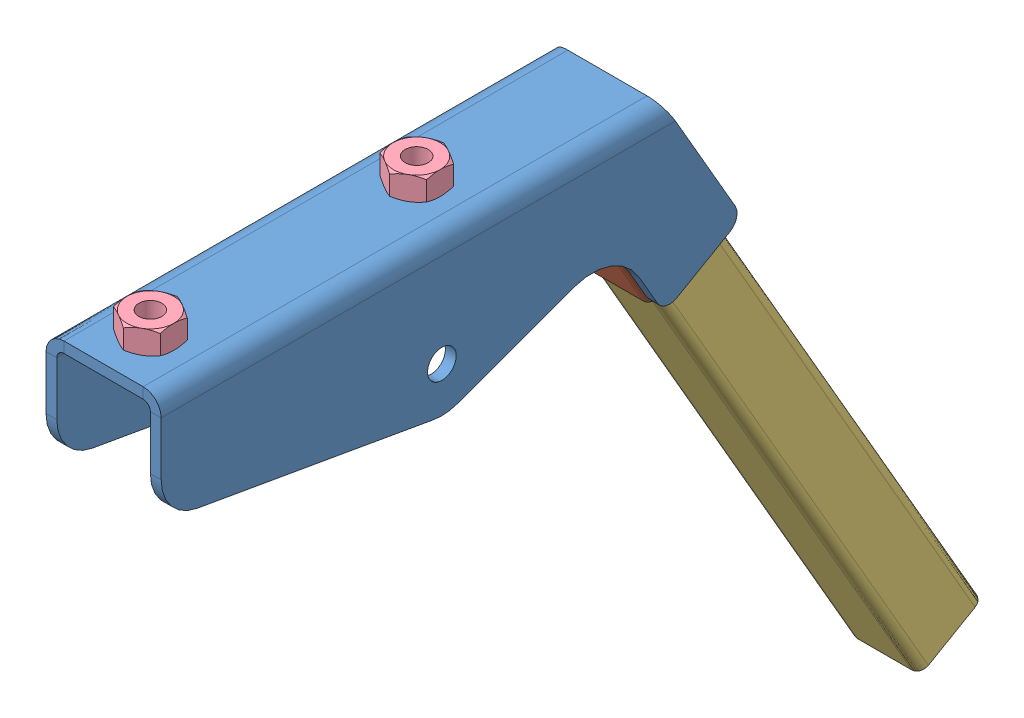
SolidWorks assembly Bas de dossier.SLDASM, configuration Défaut (file format 7000). Lengths in mm.
Overall size (32 184.89 234.33).
5 component instances, 4 part files, 12 mates.
Components (placement in the parent):
- Bride de dossier-1: Bride de dossier.SLDPRT [Défaut] at origin size (32 48.27 160.04)
- Carré 25x25x2-Lg40-1: Carré 25x25x2-Lg40.SLDPRT [Défaut] at (0 -8.8481 39.3253) x (0 -0.866025 -0.5) z (1 0 0) size (40 25 25)
- Carré de dossier 20x20x2-Lg190-1: Carré de dossier 20x20x2-Lg190.SLDPRT [Défaut] at (0 -91.1205 -8.1747) x (1 0 0) z (0 0.866025 0.5) size (20 20 190)
- Ecrou hexagonal H - M8-1: Ecrou hexagonal H - M8.SLDPRT [Défaut] at (0 6.5 83) x (0.5 0 -0.866025) z (0 1 0) size (13 15.01 6.5)
- Ecrou hexagonal H - M8-2: Ecrou hexagonal H - M8.SLDPRT [Défaut] at (0 6.5 157) x (-0.5 0 -0.866025) z (0 1 0) size (13 15.01 6.5)
Mates (geometry in assembly coordinates):
- Coïncidente1: coincident aligned: plane of Bride de dossier-1 through (-13 23.1218 43.3494) normal (0 0.5 -0.866025); plane of Carré 25x25x2-Lg40-1 through (10 -37.2391 8.5) normal (0 0.5 -0.866025)
- Distance1: distance = 0.5 mm anti-aligned: plane of Bride de dossier-1 through (-13 -50 170) normal (1 0 0); plane of Carré 25x25x2-Lg40-1 through (-12.5 -38.4891 10.6651) normal (-1 0 0)
- Coïncidente3: coincident aligned: plane of Bride de dossier-1 through (-13 -110.3609 135.1506) normal (0 -0.866025 -0.5); plane of Carré 25x25x2-Lg40-1 through (10 -48.4891 27.9856) normal (0 -0.866025 -0.5)
- Distance2: distance = 0.5 mm anti-aligned: plane of Carré 25x25x2-Lg40-1 through (10 -38.2391 10.2321) normal (0 -0.5 0.866025); plane of Carré de dossier 20x20x2-Lg190-1 through (-7.5 -3.8481 30.6651) normal (0 0.5 -0.866025)
- Distance3: distance = 0.5 mm anti-aligned: plane of Carré de dossier 20x20x2-Lg190-1 through (-10 -5.0981 32.8301) normal (-1 0 0); plane of Carré 25x25x2-Lg40-1 through (-10.5 -38.4891 10.6651) normal (1 0 0)
- Coïncidente4: coincident aligned: plane of Carré 25x25x2-Lg40-1 through (10 -13.8481 47.9856) normal (0 0.866025 0.5); plane of Carré de dossier 20x20x2-Lg190-1 through (-7.5 -12.5981 45.8205) normal (0 0.866025 0.5)
- Coaxiale1: concentric aligned: cylinder of Bride de dossier-1 through (0 -48.275 157) axis (0 1 0) radius 4.5; cylinder of Ecrou hexagonal H - M8-2 through (0 -11.3137 157) axis (0 1 0) radius 3.2
- Parallèle1: parallel aligned: plane of Bride de dossier-1 through (16 0 170) normal (1 0 0); plane of Ecrou hexagonal H - M8-2 through (6.5 0 160.7528) normal (1 0 0)
- Coïncidente5: coincident anti-aligned: plane of Bride de dossier-1 through (-16 0 170) normal (0 1 0); plane of Ecrou hexagonal H - M8-2 through (-6.5 0 168.2583) normal (0 -1 0)
- Coaxiale2: concentric aligned: cylinder of Bride de dossier-1 through (0 -48.275 83) axis (0 1 0) radius 4.5; cylinder of Ecrou hexagonal H - M8-1 through (0 -11.3137 83) axis (0 1 0) radius 3.2
- Parallèle2: parallel aligned: plane of Bride de dossier-1 through (16 0 170) normal (1 0 0); plane of Ecrou hexagonal H - M8-1 through (6.5 0 79.2472) normal (1 0 0)
- Coïncidente6: coincident anti-aligned: plane of Bride de dossier-1 through (-16 0 170) normal (0 1 0); plane of Ecrou hexagonal H - M8-1 through (-13 0 83) normal (0 -1 0)
